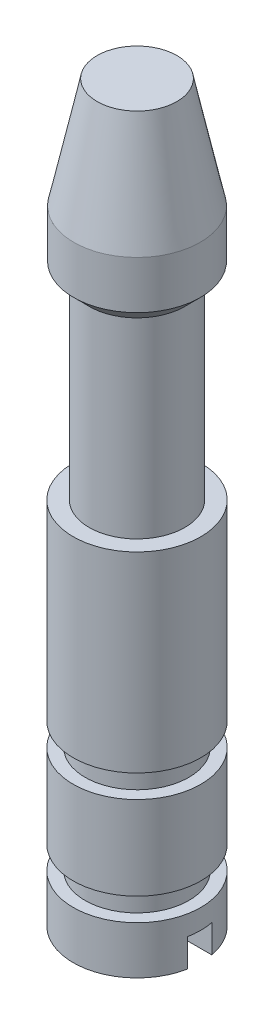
ISO-10303-21;
HEADER;
FILE_DESCRIPTION(('STEP AP214'),'2;1');
FILE_NAME('part.step','',(''),(''),'','','');
FILE_SCHEMA(('AUTOMOTIVE_DESIGN { 1 0 10303 214 1 1 1 1 }'));
ENDSEC;
DATA;
#1=APPLICATION_CONTEXT('core data for automotive mechanical design processes');
#2=APPLICATION_PROTOCOL_DEFINITION('international standard','automotive_design',2000,#1);
#3=PRODUCT_CONTEXT('',#1,'mechanical');
#4=PRODUCT('Part','Part','',(#3));
#5=PRODUCT_RELATED_PRODUCT_CATEGORY('part','',(#4));
#6=PRODUCT_DEFINITION_FORMATION('','',#4);
#7=PRODUCT_DEFINITION_CONTEXT('part definition',#1,'design');
#8=PRODUCT_DEFINITION('design','',#6,#7);
#9=PRODUCT_DEFINITION_SHAPE('','',#8);
#10=(LENGTH_UNIT() NAMED_UNIT(*) SI_UNIT(.MILLI.,.METRE.));
#11=(NAMED_UNIT(*) PLANE_ANGLE_UNIT() SI_UNIT($,.RADIAN.));
#12=(NAMED_UNIT(*) SI_UNIT($,.STERADIAN.) SOLID_ANGLE_UNIT());
#13=UNCERTAINTY_MEASURE_WITH_UNIT(LENGTH_MEASURE(1.E-05),#10,'distance_accuracy_value','');
#14=(GEOMETRIC_REPRESENTATION_CONTEXT(3) GLOBAL_UNCERTAINTY_ASSIGNED_CONTEXT((#13)) GLOBAL_UNIT_ASSIGNED_CONTEXT((#10,
#11,#12)) REPRESENTATION_CONTEXT('',''));
#15=CARTESIAN_POINT('',(0.,0.,0.));
#16=DIRECTION('',(0.,0.,1.));
#17=DIRECTION('',(1.,0.,0.));
#18=AXIS2_PLACEMENT_3D('',#15,#16,#17);
#19=CARTESIAN_POINT('',(3.175,0.,0.));
#20=DIRECTION('',(0.,-1.,0.));
#21=DIRECTION('',(0.,0.,-1.));
#22=AXIS2_PLACEMENT_3D('',#19,#20,#21);
#23=PLANE('',#22);
#24=DIRECTION('',(-1.,0.,0.));
#25=VECTOR('',#24,1.);
#26=CARTESIAN_POINT('',(3.175,0.,0.6096));
#27=LINE('',#26,#25);
#28=CARTESIAN_POINT('',(3.11592888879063,0.,0.6096));
#29=VERTEX_POINT('',#28);
#30=CARTESIAN_POINT('',(-3.11592888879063,0.,0.6096));
#31=VERTEX_POINT('',#30);
#32=EDGE_CURVE('E78',#29,#31,#27,.T.);
#33=ORIENTED_EDGE('',*,*,#32,.F.);
#34=CARTESIAN_POINT('',(0.,0.,0.));
#35=DIRECTION('',(0.,-1.,0.));
#36=DIRECTION('',(0.,0.,-1.));
#37=AXIS2_PLACEMENT_3D('',#34,#35,#36);
#38=CIRCLE('',#37,3.175);
#39=EDGE_CURVE('E90',#29,#31,#38,.T.);
#40=ORIENTED_EDGE('',*,*,#39,.T.);
#41=EDGE_LOOP('',(#33,#40));
#42=FACE_BOUND('',#41,.T.);
#43=ADVANCED_FACE('F30',(#42),#23,.T.);
#44=CARTESIAN_POINT('',(0.,36.5125,0.));
#45=DIRECTION('',(0.,1.,0.));
#46=DIRECTION('',(0.,0.,1.));
#47=AXIS2_PLACEMENT_3D('',#44,#45,#46);
#48=PLANE('',#47);
#49=CARTESIAN_POINT('',(0.,36.5125,0.));
#50=DIRECTION('',(0.,-1.,0.));
#51=DIRECTION('',(0.,0.,-1.));
#52=AXIS2_PLACEMENT_3D('',#49,#50,#51);
#53=CIRCLE('',#52,1.984375);
#54=CARTESIAN_POINT('',(0.,36.5125,-1.984375));
#55=VERTEX_POINT('',#54);
#56=EDGE_CURVE('E79',#55,#55,#53,.T.);
#57=ORIENTED_EDGE('',*,*,#56,.F.);
#58=EDGE_LOOP('',(#57));
#59=FACE_BOUND('',#58,.T.);
#60=ADVANCED_FACE('F32',(#59),#48,.T.);
#61=CARTESIAN_POINT('',(0.,31.0305473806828,0.));
#62=DIRECTION('',(0.,-1.,0.));
#63=DIRECTION('',(0.,0.,-1.));
#64=AXIS2_PLACEMENT_3D('',#61,#62,#63);
#65=CONICAL_SURFACE('',#64,3.1496,0.209439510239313);
#66=ORIENTED_EDGE('',*,*,#56,.T.);
#67=EDGE_LOOP('',(#66));
#68=FACE_BOUND('',#67,.T.);
#69=CARTESIAN_POINT('',(0.,31.0305473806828,0.));
#70=DIRECTION('',(0.,-1.,0.));
#71=DIRECTION('',(0.,0.,-1.));
#72=AXIS2_PLACEMENT_3D('',#69,#70,#71);
#73=CIRCLE('',#72,3.1496);
#74=CARTESIAN_POINT('',(0.,31.0305473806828,-3.1496));
#75=VERTEX_POINT('',#74);
#76=EDGE_CURVE('E132',#75,#75,#73,.T.);
#77=ORIENTED_EDGE('',*,*,#76,.F.);
#78=EDGE_LOOP('',(#77));
#79=FACE_BOUND('',#78,.T.);
#80=ADVANCED_FACE('F145',(#68,#79),#65,.T.);
#81=CARTESIAN_POINT('',(0.,36.5125,0.));
#82=DIRECTION('',(0.,-1.,0.));
#83=DIRECTION('',(0.,0.,-1.));
#84=AXIS2_PLACEMENT_3D('',#81,#82,#83);
#85=CYLINDRICAL_SURFACE('',#84,3.1496);
#86=ORIENTED_EDGE('',*,*,#76,.T.);
#87=EDGE_LOOP('',(#86));
#88=FACE_BOUND('',#87,.T.);
#89=CARTESIAN_POINT('',(0.,28.6492973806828,0.));
#90=DIRECTION('',(0.,-1.,0.));
#91=DIRECTION('',(0.,0.,-1.));
#92=AXIS2_PLACEMENT_3D('',#89,#90,#91);
#93=CIRCLE('',#92,3.1496);
#94=CARTESIAN_POINT('',(0.,28.6492973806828,-3.1496));
#95=VERTEX_POINT('',#94);
#96=EDGE_CURVE('E129',#95,#95,#93,.T.);
#97=ORIENTED_EDGE('',*,*,#96,.F.);
#98=EDGE_LOOP('',(#97));
#99=FACE_BOUND('',#98,.T.);
#100=ADVANCED_FACE('F201',(#88,#99),#85,.T.);
#101=CARTESIAN_POINT('',(0.,27.8809473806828,0.));
#102=DIRECTION('',(0.,1.,0.));
#103=DIRECTION('',(0.,0.,1.));
#104=AXIS2_PLACEMENT_3D('',#101,#102,#103);
#105=CONICAL_SURFACE('',#104,2.38125,0.785398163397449);
#106=ORIENTED_EDGE('',*,*,#96,.T.);
#107=EDGE_LOOP('',(#106));
#108=FACE_BOUND('',#107,.T.);
#109=CARTESIAN_POINT('',(0.,27.8809473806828,0.));
#110=DIRECTION('',(0.,-1.,0.));
#111=DIRECTION('',(0.,0.,-1.));
#112=AXIS2_PLACEMENT_3D('',#109,#110,#111);
#113=CIRCLE('',#112,2.38125);
#114=CARTESIAN_POINT('',(0.,27.8809473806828,-2.38125));
#115=VERTEX_POINT('',#114);
#116=EDGE_CURVE('E126',#115,#115,#113,.T.);
#117=ORIENTED_EDGE('',*,*,#116,.F.);
#118=EDGE_LOOP('',(#117));
#119=FACE_BOUND('',#118,.T.);
#120=ADVANCED_FACE('F197',(#108,#119),#105,.T.);
#121=CARTESIAN_POINT('',(0.,36.5125,0.));
#122=DIRECTION('',(0.,-1.,0.));
#123=DIRECTION('',(0.,0.,-1.));
#124=AXIS2_PLACEMENT_3D('',#121,#122,#123);
#125=CYLINDRICAL_SURFACE('',#124,2.38125);
#126=ORIENTED_EDGE('',*,*,#116,.T.);
#127=EDGE_LOOP('',(#126));
#128=FACE_BOUND('',#127,.T.);
#129=CARTESIAN_POINT('',(0.,18.3559473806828,0.));
#130=DIRECTION('',(0.,-1.,0.));
#131=DIRECTION('',(0.,0.,-1.));
#132=AXIS2_PLACEMENT_3D('',#129,#130,#131);
#133=CIRCLE('',#132,2.38125);
#134=CARTESIAN_POINT('',(0.,18.3559473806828,-2.38125));
#135=VERTEX_POINT('',#134);
#136=EDGE_CURVE('E123',#135,#135,#133,.T.);
#137=ORIENTED_EDGE('',*,*,#136,.F.);
#138=EDGE_LOOP('',(#137));
#139=FACE_BOUND('',#138,.T.);
#140=ADVANCED_FACE('F193',(#128,#139),#125,.T.);
#141=CARTESIAN_POINT('',(2.38125,18.3559473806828,0.));
#142=DIRECTION('',(0.,1.,0.));
#143=DIRECTION('',(0.,0.,1.));
#144=AXIS2_PLACEMENT_3D('',#141,#142,#143);
#145=PLANE('',#144);
#146=ORIENTED_EDGE('',*,*,#136,.T.);
#147=EDGE_LOOP('',(#146));
#148=FACE_BOUND('',#147,.T.);
#149=CARTESIAN_POINT('',(0.,18.3559473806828,0.));
#150=DIRECTION('',(0.,-1.,0.));
#151=DIRECTION('',(0.,0.,-1.));
#152=AXIS2_PLACEMENT_3D('',#149,#150,#151);
#153=CIRCLE('',#152,3.175);
#154=CARTESIAN_POINT('',(0.,18.3559473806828,-3.175));
#155=VERTEX_POINT('',#154);
#156=EDGE_CURVE('E120',#155,#155,#153,.T.);
#157=ORIENTED_EDGE('',*,*,#156,.F.);
#158=EDGE_LOOP('',(#157));
#159=FACE_BOUND('',#158,.T.);
#160=ADVANCED_FACE('F189',(#148,#159),#145,.T.);
#161=CARTESIAN_POINT('',(0.,36.5125,0.));
#162=DIRECTION('',(0.,-1.,0.));
#163=DIRECTION('',(0.,0.,-1.));
#164=AXIS2_PLACEMENT_3D('',#161,#162,#163);
#165=CYLINDRICAL_SURFACE('',#164,3.175);
#166=ORIENTED_EDGE('',*,*,#156,.T.);
#167=EDGE_LOOP('',(#166));
#168=FACE_BOUND('',#167,.T.);
#169=CARTESIAN_POINT('',(0.,8.83094738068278,0.));
#170=DIRECTION('',(0.,-1.,0.));
#171=DIRECTION('',(0.,0.,-1.));
#172=AXIS2_PLACEMENT_3D('',#169,#170,#171);
#173=CIRCLE('',#172,3.175);
#174=CARTESIAN_POINT('',(0.,8.83094738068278,-3.175));
#175=VERTEX_POINT('',#174);
#176=EDGE_CURVE('E117',#175,#175,#173,.T.);
#177=ORIENTED_EDGE('',*,*,#176,.F.);
#178=EDGE_LOOP('',(#177));
#179=FACE_BOUND('',#178,.T.);
#180=ADVANCED_FACE('F185',(#168,#179),#165,.T.);
#181=CARTESIAN_POINT('',(3.175,8.83094738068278,0.));
#182=DIRECTION('',(0.,-1.,0.));
#183=DIRECTION('',(0.,0.,-1.));
#184=AXIS2_PLACEMENT_3D('',#181,#182,#183);
#185=PLANE('',#184);
#186=ORIENTED_EDGE('',*,*,#176,.T.);
#187=EDGE_LOOP('',(#186));
#188=FACE_BOUND('',#187,.T.);
#189=CARTESIAN_POINT('',(0.,8.83094738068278,0.));
#190=DIRECTION('',(0.,-1.,0.));
#191=DIRECTION('',(0.,0.,-1.));
#192=AXIS2_PLACEMENT_3D('',#189,#190,#191);
#193=CIRCLE('',#192,2.5796875);
#194=CARTESIAN_POINT('',(0.,8.83094738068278,-2.5796875));
#195=VERTEX_POINT('',#194);
#196=EDGE_CURVE('E114',#195,#195,#193,.T.);
#197=ORIENTED_EDGE('',*,*,#196,.F.);
#198=EDGE_LOOP('',(#197));
#199=FACE_BOUND('',#198,.T.);
#200=ADVANCED_FACE('F181',(#188,#199),#185,.T.);
#201=CARTESIAN_POINT('',(0.,36.5125,0.));
#202=DIRECTION('',(0.,-1.,0.));
#203=DIRECTION('',(0.,0.,-1.));
#204=AXIS2_PLACEMENT_3D('',#201,#202,#203);
#205=CYLINDRICAL_SURFACE('',#204,2.5796875);
#206=ORIENTED_EDGE('',*,*,#196,.T.);
#207=EDGE_LOOP('',(#206));
#208=FACE_BOUND('',#207,.T.);
#209=CARTESIAN_POINT('',(0.,7.68794738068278,0.));
#210=DIRECTION('',(0.,-1.,0.));
#211=DIRECTION('',(0.,0.,-1.));
#212=AXIS2_PLACEMENT_3D('',#209,#210,#211);
#213=CIRCLE('',#212,2.5796875);
#214=CARTESIAN_POINT('',(0.,7.68794738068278,-2.5796875));
#215=VERTEX_POINT('',#214);
#216=EDGE_CURVE('E111',#215,#215,#213,.T.);
#217=ORIENTED_EDGE('',*,*,#216,.F.);
#218=EDGE_LOOP('',(#217));
#219=FACE_BOUND('',#218,.T.);
#220=ADVANCED_FACE('F177',(#208,#219),#205,.T.);
#221=CARTESIAN_POINT('',(2.5796875,7.68794738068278,0.));
#222=DIRECTION('',(0.,1.,0.));
#223=DIRECTION('',(0.,0.,1.));
#224=AXIS2_PLACEMENT_3D('',#221,#222,#223);
#225=PLANE('',#224);
#226=ORIENTED_EDGE('',*,*,#216,.T.);
#227=EDGE_LOOP('',(#226));
#228=FACE_BOUND('',#227,.T.);
#229=CARTESIAN_POINT('',(0.,7.68794738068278,0.));
#230=DIRECTION('',(0.,-1.,0.));
#231=DIRECTION('',(0.,0.,-1.));
#232=AXIS2_PLACEMENT_3D('',#229,#230,#231);
#233=CIRCLE('',#232,3.175);
#234=CARTESIAN_POINT('',(0.,7.68794738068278,-3.175));
#235=VERTEX_POINT('',#234);
#236=EDGE_CURVE('E108',#235,#235,#233,.T.);
#237=ORIENTED_EDGE('',*,*,#236,.F.);
#238=EDGE_LOOP('',(#237));
#239=FACE_BOUND('',#238,.T.);
#240=ADVANCED_FACE('F173',(#228,#239),#225,.T.);
#241=CARTESIAN_POINT('',(0.,36.5125,0.));
#242=DIRECTION('',(0.,-1.,0.));
#243=DIRECTION('',(0.,0.,-1.));
#244=AXIS2_PLACEMENT_3D('',#241,#242,#243);
#245=CYLINDRICAL_SURFACE('',#244,3.175);
#246=ORIENTED_EDGE('',*,*,#236,.T.);
#247=EDGE_LOOP('',(#246));
#248=FACE_BOUND('',#247,.T.);
#249=CARTESIAN_POINT('',(0.,3.52425,0.));
#250=DIRECTION('',(0.,-1.,0.));
#251=DIRECTION('',(0.,0.,-1.));
#252=AXIS2_PLACEMENT_3D('',#249,#250,#251);
#253=CIRCLE('',#252,3.17500000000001);
#254=CARTESIAN_POINT('',(0.,3.52425,-3.17500000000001));
#255=VERTEX_POINT('',#254);
#256=EDGE_CURVE('E105',#255,#255,#253,.T.);
#257=ORIENTED_EDGE('',*,*,#256,.F.);
#258=EDGE_LOOP('',(#257));
#259=FACE_BOUND('',#258,.T.);
#260=ADVANCED_FACE('F169',(#248,#259),#245,.T.);
#261=CARTESIAN_POINT('',(3.17500000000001,3.52425,0.));
#262=DIRECTION('',(0.,-1.,0.));
#263=DIRECTION('',(0.,0.,-1.));
#264=AXIS2_PLACEMENT_3D('',#261,#262,#263);
#265=PLANE('',#264);
#266=ORIENTED_EDGE('',*,*,#256,.T.);
#267=EDGE_LOOP('',(#266));
#268=FACE_BOUND('',#267,.T.);
#269=CARTESIAN_POINT('',(0.,3.52425,0.));
#270=DIRECTION('',(0.,-1.,0.));
#271=DIRECTION('',(0.,0.,-1.));
#272=AXIS2_PLACEMENT_3D('',#269,#270,#271);
#273=CIRCLE('',#272,2.5796875);
#274=CARTESIAN_POINT('',(0.,3.52425,-2.5796875));
#275=VERTEX_POINT('',#274);
#276=EDGE_CURVE('E102',#275,#275,#273,.T.);
#277=ORIENTED_EDGE('',*,*,#276,.F.);
#278=EDGE_LOOP('',(#277));
#279=FACE_BOUND('',#278,.T.);
#280=ADVANCED_FACE('F165',(#268,#279),#265,.T.);
#281=CARTESIAN_POINT('',(0.,36.5125,0.));
#282=DIRECTION('',(0.,-1.,0.));
#283=DIRECTION('',(0.,0.,-1.));
#284=AXIS2_PLACEMENT_3D('',#281,#282,#283);
#285=CYLINDRICAL_SURFACE('',#284,2.5796875);
#286=ORIENTED_EDGE('',*,*,#276,.T.);
#287=EDGE_LOOP('',(#286));
#288=FACE_BOUND('',#287,.T.);
#289=CARTESIAN_POINT('',(0.,2.38125,0.));
#290=DIRECTION('',(0.,-1.,0.));
#291=DIRECTION('',(0.,0.,-1.));
#292=AXIS2_PLACEMENT_3D('',#289,#290,#291);
#293=CIRCLE('',#292,2.5796875);
#294=CARTESIAN_POINT('',(0.,2.38125,-2.5796875));
#295=VERTEX_POINT('',#294);
#296=EDGE_CURVE('E99',#295,#295,#293,.T.);
#297=ORIENTED_EDGE('',*,*,#296,.F.);
#298=EDGE_LOOP('',(#297));
#299=FACE_BOUND('',#298,.T.);
#300=ADVANCED_FACE('F159',(#288,#299),#285,.T.);
#301=CARTESIAN_POINT('',(2.5796875,2.38125,0.));
#302=DIRECTION('',(0.,1.,0.));
#303=DIRECTION('',(0.,0.,1.));
#304=AXIS2_PLACEMENT_3D('',#301,#302,#303);
#305=PLANE('',#304);
#306=ORIENTED_EDGE('',*,*,#296,.T.);
#307=EDGE_LOOP('',(#306));
#308=FACE_BOUND('',#307,.T.);
#309=CARTESIAN_POINT('',(0.,2.38125,0.));
#310=DIRECTION('',(0.,-1.,0.));
#311=DIRECTION('',(0.,0.,-1.));
#312=AXIS2_PLACEMENT_3D('',#309,#310,#311);
#313=CIRCLE('',#312,3.17500000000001);
#314=CARTESIAN_POINT('',(0.,2.38125,-3.17500000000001));
#315=VERTEX_POINT('',#314);
#316=EDGE_CURVE('E93',#315,#315,#313,.T.);
#317=ORIENTED_EDGE('',*,*,#316,.F.);
#318=EDGE_LOOP('',(#317));
#319=FACE_BOUND('',#318,.T.);
#320=ADVANCED_FACE('F155',(#308,#319),#305,.T.);
#321=CARTESIAN_POINT('',(0.,36.5125,0.));
#322=DIRECTION('',(0.,-1.,0.));
#323=DIRECTION('',(0.,0.,-1.));
#324=AXIS2_PLACEMENT_3D('',#321,#322,#323);
#325=CYLINDRICAL_SURFACE('',#324,3.175);
#326=DIRECTION('',(0.,-1.,0.));
#327=VECTOR('',#326,1.);
#328=CARTESIAN_POINT('',(-3.11592888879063,36.5125,0.6096));
#329=LINE('',#328,#327);
#330=CARTESIAN_POINT('',(-3.11592888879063,1.397,0.6096));
#331=VERTEX_POINT('',#330);
#332=EDGE_CURVE('E53',#31,#331,#329,.F.);
#333=ORIENTED_EDGE('',*,*,#332,.F.);
#334=ORIENTED_EDGE('',*,*,#39,.F.);
#335=DIRECTION('',(0.,-1.,0.));
#336=VECTOR('',#335,1.);
#337=CARTESIAN_POINT('',(3.11592888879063,36.5125,0.6096));
#338=LINE('',#337,#336);
#339=CARTESIAN_POINT('',(3.11592888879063,1.397,0.6096));
#340=VERTEX_POINT('',#339);
#341=EDGE_CURVE('E87',#340,#29,#338,.T.);
#342=ORIENTED_EDGE('',*,*,#341,.F.);
#343=CARTESIAN_POINT('',(0.,1.397,0.));
#344=DIRECTION('',(0.,-1.,0.));
#345=DIRECTION('',(0.,0.,-1.));
#346=AXIS2_PLACEMENT_3D('',#343,#344,#345);
#347=CIRCLE('',#346,3.175);
#348=CARTESIAN_POINT('',(3.11592888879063,1.397,-0.6096));
#349=VERTEX_POINT('',#348);
#350=EDGE_CURVE('E34',#340,#349,#347,.F.);
#351=ORIENTED_EDGE('',*,*,#350,.T.);
#352=DIRECTION('',(0.,-1.,0.));
#353=VECTOR('',#352,1.);
#354=CARTESIAN_POINT('',(3.11592888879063,36.5125,-0.6096));
#355=LINE('',#354,#353);
#356=CARTESIAN_POINT('',(3.11592888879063,0.,-0.6096));
#357=VERTEX_POINT('',#356);
#358=EDGE_CURVE('E73',#357,#349,#355,.F.);
#359=ORIENTED_EDGE('',*,*,#358,.F.);
#360=CARTESIAN_POINT('',(-3.11592888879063,0.,-0.6096));
#361=VERTEX_POINT('',#360);
#362=EDGE_CURVE('E85',#361,#357,#38,.T.);
#363=ORIENTED_EDGE('',*,*,#362,.F.);
#364=DIRECTION('',(0.,-1.,0.));
#365=VECTOR('',#364,1.);
#366=CARTESIAN_POINT('',(-3.11592888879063,36.5125,-0.6096));
#367=LINE('',#366,#365);
#368=CARTESIAN_POINT('',(-3.11592888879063,1.397,-0.6096));
#369=VERTEX_POINT('',#368);
#370=EDGE_CURVE('E45',#369,#361,#367,.T.);
#371=ORIENTED_EDGE('',*,*,#370,.F.);
#372=EDGE_CURVE('E11',#369,#331,#347,.F.);
#373=ORIENTED_EDGE('',*,*,#372,.T.);
#374=EDGE_LOOP('',(#333,#334,#342,#351,#359,#363,#371,#373));
#375=FACE_BOUND('',#374,.T.);
#376=ORIENTED_EDGE('',*,*,#316,.T.);
#377=EDGE_LOOP('',(#376));
#378=FACE_BOUND('',#377,.T.);
#379=ADVANCED_FACE('F83',(#375,#378),#325,.T.);
#380=DIRECTION('',(1.,0.,0.));
#381=VECTOR('',#380,1.);
#382=CARTESIAN_POINT('',(3.175,0.,-0.6096));
#383=LINE('',#382,#381);
#384=EDGE_CURVE('E70',#361,#357,#383,.T.);
#385=ORIENTED_EDGE('',*,*,#384,.F.);
#386=ORIENTED_EDGE('',*,*,#362,.T.);
#387=EDGE_LOOP('',(#385,#386));
#388=FACE_BOUND('',#387,.T.);
#389=ADVANCED_FACE('F89',(#388),#23,.T.);
#390=CARTESIAN_POINT('',(-3.175,1.397,0.6096));
#391=DIRECTION('',(0.,0.,1.));
#392=DIRECTION('',(1.,0.,0.));
#393=AXIS2_PLACEMENT_3D('',#390,#391,#392);
#394=PLANE('',#393);
#395=ORIENTED_EDGE('',*,*,#332,.T.);
#396=DIRECTION('',(-1.,0.,0.));
#397=VECTOR('',#396,1.);
#398=CARTESIAN_POINT('',(-3.175,1.397,0.6096));
#399=LINE('',#398,#397);
#400=EDGE_CURVE('E326',#340,#331,#399,.T.);
#401=ORIENTED_EDGE('',*,*,#400,.F.);
#402=ORIENTED_EDGE('',*,*,#341,.T.);
#403=ORIENTED_EDGE('',*,*,#32,.T.);
#404=EDGE_LOOP('',(#395,#401,#402,#403));
#405=FACE_BOUND('',#404,.T.);
#406=ADVANCED_FACE('F137',(#405),#394,.F.);
#407=CARTESIAN_POINT('',(-3.175,1.397,-0.6096));
#408=DIRECTION('',(0.,0.,-1.));
#409=DIRECTION('',(-1.,0.,0.));
#410=AXIS2_PLACEMENT_3D('',#407,#408,#409);
#411=PLANE('',#410);
#412=ORIENTED_EDGE('',*,*,#358,.T.);
#413=DIRECTION('',(1.,0.,0.));
#414=VECTOR('',#413,1.);
#415=CARTESIAN_POINT('',(-3.175,1.397,-0.6096));
#416=LINE('',#415,#414);
#417=EDGE_CURVE('E325',#369,#349,#416,.T.);
#418=ORIENTED_EDGE('',*,*,#417,.F.);
#419=ORIENTED_EDGE('',*,*,#370,.T.);
#420=ORIENTED_EDGE('',*,*,#384,.T.);
#421=EDGE_LOOP('',(#412,#418,#419,#420));
#422=FACE_BOUND('',#421,.T.);
#423=ADVANCED_FACE('F72',(#422),#411,.F.);
#424=CARTESIAN_POINT('',(-3.175,1.397,-0.6096));
#425=DIRECTION('',(0.,-1.,0.));
#426=DIRECTION('',(0.,0.,-1.));
#427=AXIS2_PLACEMENT_3D('',#424,#425,#426);
#428=PLANE('',#427);
#429=ORIENTED_EDGE('',*,*,#417,.T.);
#430=ORIENTED_EDGE('',*,*,#350,.F.);
#431=ORIENTED_EDGE('',*,*,#400,.T.);
#432=ORIENTED_EDGE('',*,*,#372,.F.);
#433=EDGE_LOOP('',(#429,#430,#431,#432));
#434=FACE_BOUND('',#433,.T.);
#435=ADVANCED_FACE('F313',(#434),#428,.T.);
#436=CLOSED_SHELL('',(#43,#60,#80,#100,#120,#140,#160,#180,#200,#220,#240,#260,#280,#300,#320,
#379,#389,#406,#423,#435));
#437=MANIFOLD_SOLID_BREP('B2',#436);
#438=ADVANCED_BREP_SHAPE_REPRESENTATION('',(#18,#437),#14);
#439=SHAPE_DEFINITION_REPRESENTATION(#9,#438);
ENDSEC;
END-ISO-10303-21;
